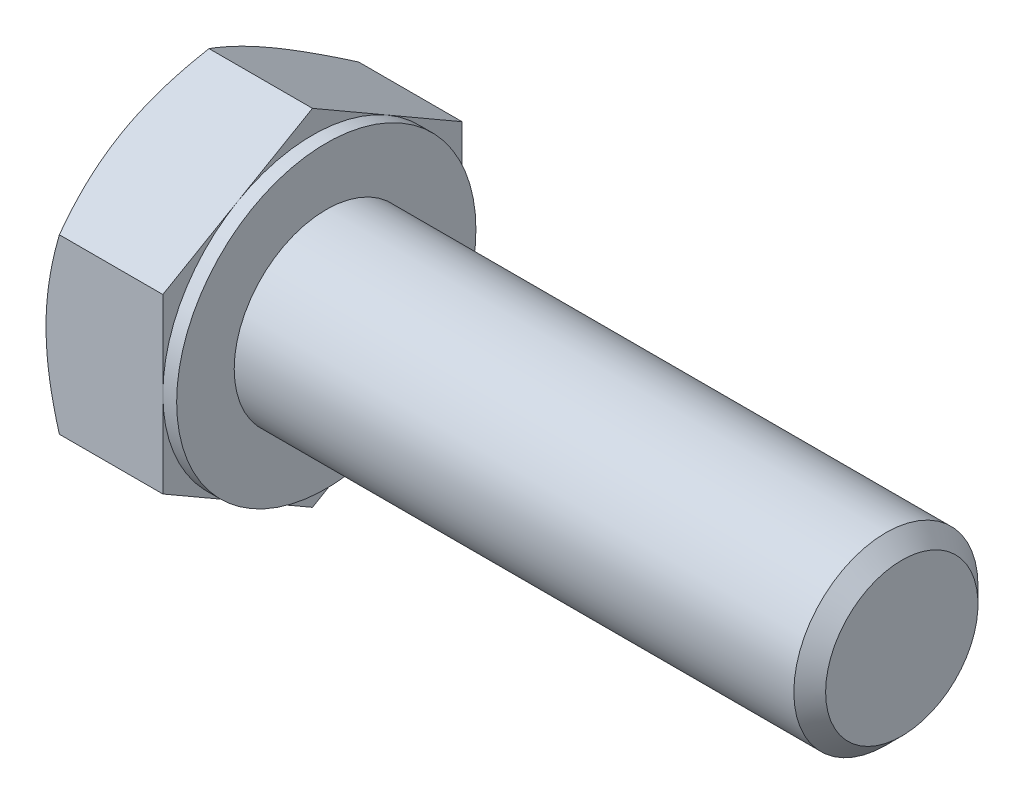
from build123d import *

# Parameters (mm, degrees)
BASEHEAD_DEPTH = 5.675
SKETCH4_W      = 0.6
SKETCH4_H      = 11.005553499


with BuildPart() as part:
    # Sketch1 → BaseHead (new body)
    with BuildSketch(Plane(origin=(0, 0, 0), x_dir=(0, 0, -1), z_dir=(1, 0, 0))):
        Polygon((6.5, 3.75277675), (6.5, -3.75277675), (0, -7.505553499), (-6.5, -3.75277675), (-6.5, 3.75277675), (0, 7.505553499), align=None)
    extrude(amount=BASEHEAD_DEPTH)

    # BodySke → BaseBody (revolve)
    with BuildSketch(Plane.XY, mode=Mode.PRIVATE) as basebody_sk:
        Polygon((0, 0), (30.675, 0), (30.675, 3.3095), (29.9845, 4), (0, 4), align=None)
    revolve(basebody_sk.sketch.rotate(Axis((0, 0, 0), (1, 0, 0)), 90), axis=Axis((0, 0, 0), (1, 0, 0)))

    # Sketch3 → HeadChamfer (revolve, cut)
    with BuildSketch(Plane.XY):
        Polygon((0, 6.5), (3.46730793, 12.505553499), (3.46730793, 17.505553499), (-10, 17.505553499), (-10, 6.5), align=None)
    revolve(axis=Axis((0, 0, 0), (1, 0, 0)), mode=Mode.SUBTRACT)

    # Sketch4 → BearingFace (revolve, cut)
    with BuildSketch(Plane.XY, mode=Mode.PRIVATE) as bearingface_sk:
        with Locations((5.375, 12.00277675)):
            Rectangle(SKETCH4_W, SKETCH4_H)
    revolve(bearingface_sk.sketch.rotate(Axis((0, 0, 0), (1, 0, 0)), 270), axis=Axis((0, 0, 0), (1, 0, 0)), mode=Mode.SUBTRACT)


solid = part.part
